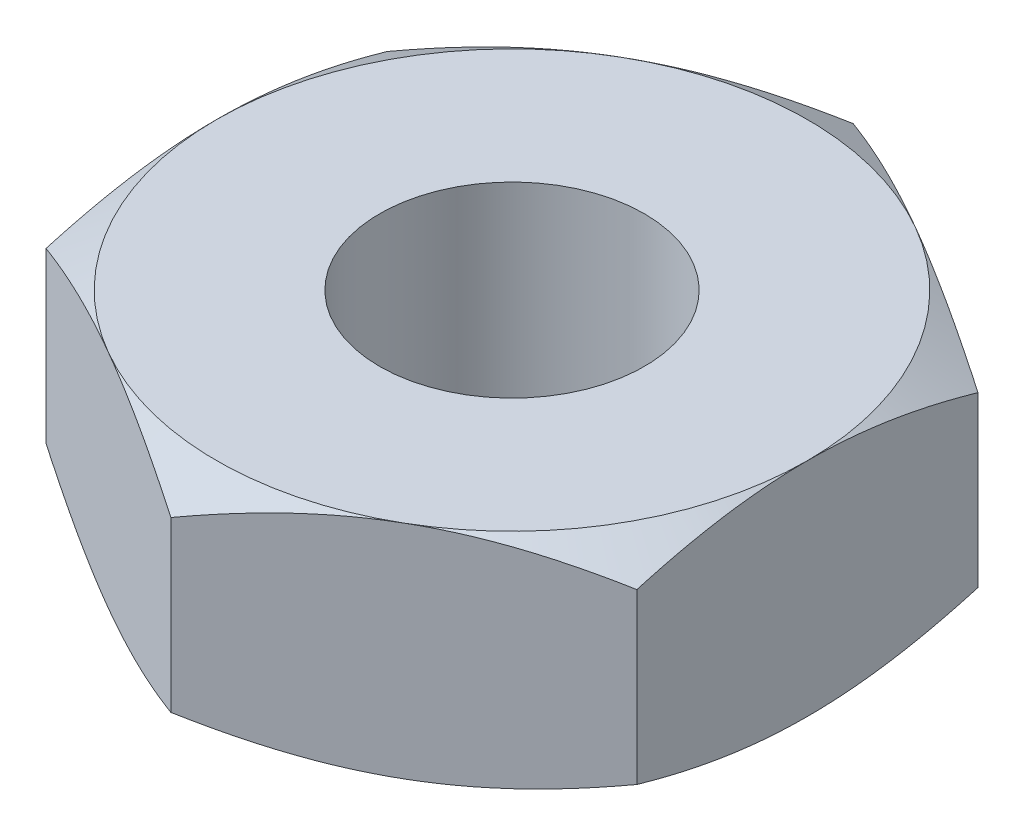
ISO-10303-21;
HEADER;
FILE_DESCRIPTION(('STEP AP214'),'2;1');
FILE_NAME('part.step','',(''),(''),'','','');
FILE_SCHEMA(('AUTOMOTIVE_DESIGN { 1 0 10303 214 1 1 1 1 }'));
ENDSEC;
DATA;
#1=APPLICATION_CONTEXT('core data for automotive mechanical design processes');
#2=APPLICATION_PROTOCOL_DEFINITION('international standard','automotive_design',2000,#1);
#3=PRODUCT_CONTEXT('',#1,'mechanical');
#4=PRODUCT('Part','Part','',(#3));
#5=PRODUCT_RELATED_PRODUCT_CATEGORY('part','',(#4));
#6=PRODUCT_DEFINITION_FORMATION('','',#4);
#7=PRODUCT_DEFINITION_CONTEXT('part definition',#1,'design');
#8=PRODUCT_DEFINITION('design','',#6,#7);
#9=PRODUCT_DEFINITION_SHAPE('','',#8);
#10=(LENGTH_UNIT() NAMED_UNIT(*) SI_UNIT(.MILLI.,.METRE.));
#11=(NAMED_UNIT(*) PLANE_ANGLE_UNIT() SI_UNIT($,.RADIAN.));
#12=(NAMED_UNIT(*) SI_UNIT($,.STERADIAN.) SOLID_ANGLE_UNIT());
#13=UNCERTAINTY_MEASURE_WITH_UNIT(LENGTH_MEASURE(1.E-05),#10,'distance_accuracy_value','');
#14=(GEOMETRIC_REPRESENTATION_CONTEXT(3) GLOBAL_UNCERTAINTY_ASSIGNED_CONTEXT((#13)) GLOBAL_UNIT_ASSIGNED_CONTEXT((#10,
#11,#12)) REPRESENTATION_CONTEXT('',''));
#15=CARTESIAN_POINT('',(0.,0.,0.));
#16=DIRECTION('',(0.,0.,1.));
#17=DIRECTION('',(1.,0.,0.));
#18=AXIS2_PLACEMENT_3D('',#15,#16,#17);
#19=CARTESIAN_POINT('',(-3.175,1.190625,-1.83308710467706));
#20=DIRECTION('',(0.,1.,0.));
#21=DIRECTION('',(0.,0.,1.));
#22=AXIS2_PLACEMENT_3D('',#19,#20,#21);
#23=PLANE('',#22);
#24=CARTESIAN_POINT('',(0.,1.190625,0.));
#25=DIRECTION('',(0.,1.,0.));
#26=DIRECTION('',(0.,0.,1.));
#27=AXIS2_PLACEMENT_3D('',#24,#25,#26);
#28=CIRCLE('',#27,1.4224);
#29=CARTESIAN_POINT('',(0.,1.190625,-1.4224));
#30=VERTEX_POINT('',#29);
#31=EDGE_CURVE('E240',#30,#30,#28,.T.);
#32=ORIENTED_EDGE('',*,*,#31,.F.);
#33=EDGE_LOOP('',(#32));
#34=FACE_BOUND('',#33,.T.);
#35=CARTESIAN_POINT('',(0.,1.190625,0.));
#36=DIRECTION('',(0.,1.,0.));
#37=DIRECTION('',(0.,0.,1.));
#38=AXIS2_PLACEMENT_3D('',#35,#36,#37);
#39=CIRCLE('',#38,3.175);
#40=CARTESIAN_POINT('',(-1.5875,1.190625,2.74963065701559));
#41=VERTEX_POINT('',#40);
#42=CARTESIAN_POINT('',(1.5875,1.190625,2.74963065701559));
#43=VERTEX_POINT('',#42);
#44=EDGE_CURVE('E299',#41,#43,#39,.T.);
#45=ORIENTED_EDGE('',*,*,#44,.T.);
#46=CARTESIAN_POINT('',(3.175,1.190625,0.));
#47=VERTEX_POINT('',#46);
#48=EDGE_CURVE('E302',#43,#47,#39,.T.);
#49=ORIENTED_EDGE('',*,*,#48,.T.);
#50=CARTESIAN_POINT('',(1.5875,1.190625,-2.74963065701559));
#51=VERTEX_POINT('',#50);
#52=EDGE_CURVE('E309',#47,#51,#39,.T.);
#53=ORIENTED_EDGE('',*,*,#52,.T.);
#54=CARTESIAN_POINT('',(-1.5875,1.190625,-2.74963065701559));
#55=VERTEX_POINT('',#54);
#56=EDGE_CURVE('E313',#51,#55,#39,.T.);
#57=ORIENTED_EDGE('',*,*,#56,.T.);
#58=CARTESIAN_POINT('',(-3.175,1.190625,0.));
#59=VERTEX_POINT('',#58);
#60=EDGE_CURVE('E306',#55,#59,#39,.T.);
#61=ORIENTED_EDGE('',*,*,#60,.T.);
#62=EDGE_CURVE('E301',#59,#41,#39,.T.);
#63=ORIENTED_EDGE('',*,*,#62,.T.);
#64=EDGE_LOOP('',(#45,#49,#53,#57,#61,#63));
#65=FACE_BOUND('',#64,.T.);
#66=ADVANCED_FACE('F36',(#34,#65),#23,.T.);
#67=CARTESIAN_POINT('',(0.,1.190625,-3.66617420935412));
#68=DIRECTION('',(0.5,0.,0.866025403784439));
#69=DIRECTION('',(0.866025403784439,0.,-0.5));
#70=AXIS2_PLACEMENT_3D('',#67,#68,#69);
#71=PLANE('',#70);
#72=DIRECTION('',(0.,-1.,0.));
#73=VECTOR('',#72,1.);
#74=CARTESIAN_POINT('',(0.,1.190625,-3.66617420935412));
#75=LINE('',#74,#73);
#76=CARTESIAN_POINT('',(0.,0.907045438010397,-3.66617420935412));
#77=VERTEX_POINT('',#76);
#78=CARTESIAN_POINT('',(0.,-0.907045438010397,-3.66617420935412));
#79=VERTEX_POINT('',#78);
#80=EDGE_CURVE('E237',#77,#79,#75,.T.);
#81=ORIENTED_EDGE('',*,*,#80,.T.);
#82=CARTESIAN_POINT('',(0.000199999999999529,-0.906978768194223,-3.66628967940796));
#83=CARTESIAN_POINT('',(-0.139325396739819,-0.953505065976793,-3.58573465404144));
#84=CARTESIAN_POINT('',(-0.280055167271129,-0.995819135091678,-3.50448428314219));
#85=CARTESIAN_POINT('',(-0.563951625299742,-1.06967899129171,-3.34057658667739));
#86=CARTESIAN_POINT('',(-0.707123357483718,-1.10119864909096,-3.25791634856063));
#87=CARTESIAN_POINT('',(-0.991692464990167,-1.15026389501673,-3.09362029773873));
#88=CARTESIAN_POINT('',(-1.1330460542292,-1.16813603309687,-3.01200976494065));
#89=CARTESIAN_POINT('',(-1.41641839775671,-1.1894721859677,-2.84840466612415));
#90=CARTESIAN_POINT('',(-1.55843612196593,-1.1929538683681,-2.76641069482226));
#91=CARTESIAN_POINT('',(-1.82380736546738,-1.18571329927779,-2.61319853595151));
#92=CARTESIAN_POINT('',(-1.94720059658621,-1.17676885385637,-2.54195742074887));
#93=CARTESIAN_POINT('',(-2.19318314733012,-1.14841942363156,-2.39993932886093));
#94=CARTESIAN_POINT('',(-2.31577161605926,-1.12900475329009,-2.32916284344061));
#95=CARTESIAN_POINT('',(-2.5622613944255,-1.08046926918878,-2.18685190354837));
#96=CARTESIAN_POINT('',(-2.68613150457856,-1.0511427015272,-2.11533546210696));
#97=CARTESIAN_POINT('',(-2.93202416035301,-0.984582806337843,-1.97336927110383));
#98=CARTESIAN_POINT('',(-3.05404985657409,-0.947365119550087,-1.90291770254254));
#99=CARTESIAN_POINT('',(-3.1752,-0.906978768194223,-1.83297163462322));
#100=B_SPLINE_CURVE_WITH_KNOTS('',3,(#82,#83,#84,#85,#86,#87,#88,#89,#90,#91,#92,#93,#94,#95,
#96,#97,#98,#99),.UNSPECIFIED.,.F.,.F.,(4,2,2,2,2,2,2,2,4),(0.,0.503278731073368,
1.00776724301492,1.49976968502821,1.99116790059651,2.41904879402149,2.84732618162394,
3.28510386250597,3.72202181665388),.UNSPECIFIED.);
#101=CARTESIAN_POINT('',(-1.5875,-1.190625,-2.74963065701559));
#102=VERTEX_POINT('',#101);
#103=EDGE_CURVE('E59',#79,#102,#100,.T.);
#104=ORIENTED_EDGE('',*,*,#103,.T.);
#105=CARTESIAN_POINT('',(-3.175,-0.907045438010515,-1.83308710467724));
#106=VERTEX_POINT('',#105);
#107=EDGE_CURVE('E195',#102,#106,#100,.T.);
#108=ORIENTED_EDGE('',*,*,#107,.T.);
#109=DIRECTION('',(0.,-1.,0.));
#110=VECTOR('',#109,1.);
#111=CARTESIAN_POINT('',(-3.175,1.190625,-1.83308710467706));
#112=LINE('',#111,#110);
#113=CARTESIAN_POINT('',(-3.175,0.907045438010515,-1.83308710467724));
#114=VERTEX_POINT('',#113);
#115=EDGE_CURVE('E225',#114,#106,#112,.T.);
#116=ORIENTED_EDGE('',*,*,#115,.F.);
#117=CARTESIAN_POINT('',(0.000199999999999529,0.906978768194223,-3.66628967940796));
#118=CARTESIAN_POINT('',(-0.139325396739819,0.953505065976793,-3.58573465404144));
#119=CARTESIAN_POINT('',(-0.280055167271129,0.995819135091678,-3.50448428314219));
#120=CARTESIAN_POINT('',(-0.563951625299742,1.06967899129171,-3.34057658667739));
#121=CARTESIAN_POINT('',(-0.707123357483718,1.10119864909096,-3.25791634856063));
#122=CARTESIAN_POINT('',(-0.991692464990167,1.15026389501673,-3.09362029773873));
#123=CARTESIAN_POINT('',(-1.1330460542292,1.16813603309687,-3.01200976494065));
#124=CARTESIAN_POINT('',(-1.41641839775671,1.1894721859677,-2.84840466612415));
#125=CARTESIAN_POINT('',(-1.55843612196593,1.1929538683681,-2.76641069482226));
#126=CARTESIAN_POINT('',(-1.82380736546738,1.18571329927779,-2.61319853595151));
#127=CARTESIAN_POINT('',(-1.94720059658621,1.17676885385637,-2.54195742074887));
#128=CARTESIAN_POINT('',(-2.19318314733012,1.14841942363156,-2.39993932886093));
#129=CARTESIAN_POINT('',(-2.31577161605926,1.12900475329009,-2.32916284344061));
#130=CARTESIAN_POINT('',(-2.5622613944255,1.08046926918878,-2.18685190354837));
#131=CARTESIAN_POINT('',(-2.68613150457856,1.0511427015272,-2.11533546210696));
#132=CARTESIAN_POINT('',(-2.93202416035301,0.984582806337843,-1.97336927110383));
#133=CARTESIAN_POINT('',(-3.05404985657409,0.947365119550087,-1.90291770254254));
#134=CARTESIAN_POINT('',(-3.1752,0.906978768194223,-1.83297163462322));
#135=B_SPLINE_CURVE_WITH_KNOTS('',3,(#117,#118,#119,#120,#121,#122,#123,#124,#125,#126,#127,
#128,#129,#130,#131,#132,#133,#134),.UNSPECIFIED.,.F.,.F.,(4,2,2,2,2,2,2,2,4),(0.,
0.503278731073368,1.00776724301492,1.49976968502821,1.99116790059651,2.41904879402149,
2.84732618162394,3.28510386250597,3.72202181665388),.UNSPECIFIED.);
#136=EDGE_CURVE('E247',#55,#114,#135,.T.);
#137=ORIENTED_EDGE('',*,*,#136,.F.);
#138=EDGE_CURVE('E244',#77,#55,#135,.T.);
#139=ORIENTED_EDGE('',*,*,#138,.F.);
#140=EDGE_LOOP('',(#81,#104,#108,#116,#137,#139));
#141=FACE_BOUND('',#140,.T.);
#142=ADVANCED_FACE('F38',(#141),#71,.F.);
#143=CARTESIAN_POINT('',(-3.175,1.190625,-1.83308710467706));
#144=DIRECTION('',(1.,0.,0.));
#145=DIRECTION('',(0.,0.,-1.));
#146=AXIS2_PLACEMENT_3D('',#143,#144,#145);
#147=PLANE('',#146);
#148=ORIENTED_EDGE('',*,*,#115,.T.);
#149=CARTESIAN_POINT('',(-3.175,0.390294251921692,-4.9885562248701));
#150=CARTESIAN_POINT('',(-3.175,0.322489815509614,-4.84930985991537));
#151=CARTESIAN_POINT('',(-3.175,0.255317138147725,-4.70975067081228));
#152=CARTESIAN_POINT('',(-3.175,0.12258942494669,-4.42984049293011));
#153=CARTESIAN_POINT('',(-3.175,0.057034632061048,-4.28948938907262));
#154=CARTESIAN_POINT('',(-3.175,-0.0724191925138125,-4.00713685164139));
#155=CARTESIAN_POINT('',(-3.175,-0.136307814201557,-3.86513062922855));
#156=CARTESIAN_POINT('',(-3.175,-0.261554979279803,-3.58001091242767));
#157=CARTESIAN_POINT('',(-3.175,-0.322913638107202,-3.43689746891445));
#158=CARTESIAN_POINT('',(-3.175,-0.444440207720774,-3.14451125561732));
#159=CARTESIAN_POINT('',(-3.175,-0.504499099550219,-2.99519293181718));
#160=CARTESIAN_POINT('',(-3.175,-0.620225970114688,-2.69483347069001));
#161=CARTESIAN_POINT('',(-3.175,-0.675893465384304,-2.54379214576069));
#162=CARTESIAN_POINT('',(-3.175,-0.781423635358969,-2.24000862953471));
#163=CARTESIAN_POINT('',(-3.175,-0.831297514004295,-2.08727036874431));
#164=CARTESIAN_POINT('',(-3.175,-0.923683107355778,-1.77960380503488));
#165=CARTESIAN_POINT('',(-3.175,-0.966197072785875,-1.62467618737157));
#166=CARTESIAN_POINT('',(-3.175,-1.04164079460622,-1.31339705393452));
#167=CARTESIAN_POINT('',(-3.175,-1.07462373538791,-1.15705866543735));
#168=CARTESIAN_POINT('',(-3.175,-1.12918141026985,-0.842371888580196));
#169=CARTESIAN_POINT('',(-3.175,-1.15075736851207,-0.684023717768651));
#170=CARTESIAN_POINT('',(-3.175,-1.18050055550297,-0.368202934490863));
#171=CARTESIAN_POINT('',(-3.175,-1.18884523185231,-0.210747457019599));
#172=CARTESIAN_POINT('',(-3.175,-1.1918898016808,0.104311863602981));
#173=CARTESIAN_POINT('',(-3.175,-1.18658947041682,0.261915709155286));
#174=CARTESIAN_POINT('',(-3.175,-1.16653654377,0.527563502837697));
#175=CARTESIAN_POINT('',(-3.175,-1.15520814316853,0.635883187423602));
#176=CARTESIAN_POINT('',(-3.175,-1.12677659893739,0.851767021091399));
#177=CARTESIAN_POINT('',(-3.175,-1.10967272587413,0.959331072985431));
#178=CARTESIAN_POINT('',(-3.175,-1.05059305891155,1.28072262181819));
#179=CARTESIAN_POINT('',(-3.175,-1.00085846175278,1.49314180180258));
#180=CARTESIAN_POINT('',(-3.175,-0.914125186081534,1.81092381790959));
#181=CARTESIAN_POINT('',(-3.175,-0.882764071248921,1.91791944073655));
#182=CARTESIAN_POINT('',(-3.175,-0.816663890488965,2.13087224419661));
#183=CARTESIAN_POINT('',(-3.175,-0.781924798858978,2.2368294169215));
#184=CARTESIAN_POINT('',(-3.175,-0.709636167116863,2.44773776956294));
#185=CARTESIAN_POINT('',(-3.175,-0.672087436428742,2.55268922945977));
#186=CARTESIAN_POINT('',(-3.175,-0.594633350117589,2.76171343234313));
#187=CARTESIAN_POINT('',(-3.175,-0.554728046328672,2.86578619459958));
#188=CARTESIAN_POINT('',(-3.175,-0.445219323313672,3.14347672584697));
#189=CARTESIAN_POINT('',(-3.175,-0.37382985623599,3.31638946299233));
#190=CARTESIAN_POINT('',(-3.175,-0.226917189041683,3.6604562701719));
#191=CARTESIAN_POINT('',(-3.175,-0.151393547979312,3.83161015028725));
#192=CARTESIAN_POINT('',(-3.175,0.00281456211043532,4.17255282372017));
#193=CARTESIAN_POINT('',(-3.175,0.0815000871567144,4.34234113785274));
#194=CARTESIAN_POINT('',(-3.175,0.241296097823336,4.68077493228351));
#195=CARTESIAN_POINT('',(-3.175,0.32240665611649,4.84942037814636));
#196=CARTESIAN_POINT('',(-3.175,0.568804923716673,5.35449457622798));
#197=CARTESIAN_POINT('',(-3.175,0.736920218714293,5.68954214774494));
#198=CARTESIAN_POINT('',(-3.175,1.0778933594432,6.35711088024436));
#199=CARTESIAN_POINT('',(-3.175,1.25075023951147,6.68963253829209));
#200=CARTESIAN_POINT('',(-3.175,1.58151406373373,7.31837652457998));
#201=CARTESIAN_POINT('',(-3.175,1.73910012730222,7.61476795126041));
#202=CARTESIAN_POINT('',(-3.175,2.05618136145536,8.20654888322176));
#203=CARTESIAN_POINT('',(-3.175,2.21567664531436,8.50193832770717));
#204=CARTESIAN_POINT('',(-3.175,2.53555835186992,9.09097563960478));
#205=CARTESIAN_POINT('',(-3.175,2.6959401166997,9.38462603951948));
#206=CARTESIAN_POINT('',(-3.175,3.01779202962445,9.97130061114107));
#207=CARTESIAN_POINT('',(-3.175,3.1792620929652,10.2643248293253));
#208=CARTESIAN_POINT('',(-3.175,3.34112844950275,10.5571284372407));
#209=B_SPLINE_CURVE_WITH_KNOTS('',3,(#149,#150,#151,#152,#153,#154,#155,#156,#157,#158,#159,
#160,#161,#162,#163,#164,#165,#166,#167,#168,#169,#170,#171,#172,#173,#174,#175,#176,#177,#178,
#179,#180,#181,#182,#183,#184,#185,#186,#187,#188,#189,#190,#191,#192,#193,#194,#195,#196,#197,
#198,#199,#200,#201,#202,#203,#204,#205,#206,#207,#208),.UNSPECIFIED.,.F.,.F.,(4,2,2,2,2,2,2,2,
2,2,2,2,2,2,2,2,2,2,2,2,2,2,2,2,2,2,2,2,2,4),(0.,0.464637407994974,0.929344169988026,
1.39647286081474,1.86358021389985,2.34635936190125,2.82919158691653,3.31107397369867,
3.79280873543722,4.27180101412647,4.75074187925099,5.22320352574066,5.6956729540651,
6.0222471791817,6.34886266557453,7.00241647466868,7.33687734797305,7.67134076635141,
8.00570819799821,8.34006827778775,8.90119903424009,9.46238975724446,10.0237694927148,
10.5851660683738,11.7096730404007,12.8339526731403,13.8409839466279,14.8480752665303,
15.8518534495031,16.8555543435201),.UNSPECIFIED.);
#210=CARTESIAN_POINT('',(-3.175,-1.190625,0.));
#211=VERTEX_POINT('',#210);
#212=EDGE_CURVE('E280',#106,#211,#209,.T.);
#213=ORIENTED_EDGE('',*,*,#212,.T.);
#214=CARTESIAN_POINT('',(-3.175,-0.907045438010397,1.83308710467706));
#215=VERTEX_POINT('',#214);
#216=EDGE_CURVE('E274',#211,#215,#209,.T.);
#217=ORIENTED_EDGE('',*,*,#216,.T.);
#218=DIRECTION('',(0.,-1.,0.));
#219=VECTOR('',#218,1.);
#220=CARTESIAN_POINT('',(-3.175,1.190625,1.83308710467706));
#221=LINE('',#220,#219);
#222=CARTESIAN_POINT('',(-3.175,0.907045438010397,1.83308710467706));
#223=VERTEX_POINT('',#222);
#224=EDGE_CURVE('E228',#223,#215,#221,.T.);
#225=ORIENTED_EDGE('',*,*,#224,.F.);
#226=CARTESIAN_POINT('',(-3.175,-0.390294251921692,-4.9885562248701));
#227=CARTESIAN_POINT('',(-3.175,-0.322489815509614,-4.84930985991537));
#228=CARTESIAN_POINT('',(-3.175,-0.255317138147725,-4.70975067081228));
#229=CARTESIAN_POINT('',(-3.175,-0.12258942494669,-4.42984049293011));
#230=CARTESIAN_POINT('',(-3.175,-0.057034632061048,-4.28948938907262));
#231=CARTESIAN_POINT('',(-3.175,0.0724191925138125,-4.00713685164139));
#232=CARTESIAN_POINT('',(-3.175,0.136307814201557,-3.86513062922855));
#233=CARTESIAN_POINT('',(-3.175,0.261554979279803,-3.58001091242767));
#234=CARTESIAN_POINT('',(-3.175,0.322913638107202,-3.43689746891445));
#235=CARTESIAN_POINT('',(-3.175,0.444440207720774,-3.14451125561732));
#236=CARTESIAN_POINT('',(-3.175,0.504499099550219,-2.99519293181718));
#237=CARTESIAN_POINT('',(-3.175,0.620225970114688,-2.69483347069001));
#238=CARTESIAN_POINT('',(-3.175,0.675893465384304,-2.54379214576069));
#239=CARTESIAN_POINT('',(-3.175,0.781423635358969,-2.24000862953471));
#240=CARTESIAN_POINT('',(-3.175,0.831297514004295,-2.08727036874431));
#241=CARTESIAN_POINT('',(-3.175,0.923683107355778,-1.77960380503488));
#242=CARTESIAN_POINT('',(-3.175,0.966197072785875,-1.62467618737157));
#243=CARTESIAN_POINT('',(-3.175,1.04164079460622,-1.31339705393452));
#244=CARTESIAN_POINT('',(-3.175,1.07462373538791,-1.15705866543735));
#245=CARTESIAN_POINT('',(-3.175,1.12918141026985,-0.842371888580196));
#246=CARTESIAN_POINT('',(-3.175,1.15075736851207,-0.684023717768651));
#247=CARTESIAN_POINT('',(-3.175,1.18050055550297,-0.368202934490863));
#248=CARTESIAN_POINT('',(-3.175,1.18884523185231,-0.210747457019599));
#249=CARTESIAN_POINT('',(-3.175,1.1918898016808,0.104311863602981));
#250=CARTESIAN_POINT('',(-3.175,1.18658947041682,0.261915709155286));
#251=CARTESIAN_POINT('',(-3.175,1.16653654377,0.527563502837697));
#252=CARTESIAN_POINT('',(-3.175,1.15520814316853,0.635883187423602));
#253=CARTESIAN_POINT('',(-3.175,1.12677659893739,0.851767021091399));
#254=CARTESIAN_POINT('',(-3.175,1.10967272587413,0.959331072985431));
#255=CARTESIAN_POINT('',(-3.175,1.05059305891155,1.28072262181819));
#256=CARTESIAN_POINT('',(-3.175,1.00085846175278,1.49314180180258));
#257=CARTESIAN_POINT('',(-3.175,0.914125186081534,1.81092381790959));
#258=CARTESIAN_POINT('',(-3.175,0.882764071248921,1.91791944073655));
#259=CARTESIAN_POINT('',(-3.175,0.816663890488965,2.13087224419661));
#260=CARTESIAN_POINT('',(-3.175,0.781924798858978,2.2368294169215));
#261=CARTESIAN_POINT('',(-3.175,0.709636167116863,2.44773776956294));
#262=CARTESIAN_POINT('',(-3.175,0.672087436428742,2.55268922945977));
#263=CARTESIAN_POINT('',(-3.175,0.594633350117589,2.76171343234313));
#264=CARTESIAN_POINT('',(-3.175,0.554728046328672,2.86578619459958));
#265=CARTESIAN_POINT('',(-3.175,0.445219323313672,3.14347672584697));
#266=CARTESIAN_POINT('',(-3.175,0.37382985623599,3.31638946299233));
#267=CARTESIAN_POINT('',(-3.175,0.226917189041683,3.6604562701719));
#268=CARTESIAN_POINT('',(-3.175,0.151393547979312,3.83161015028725));
#269=CARTESIAN_POINT('',(-3.175,-0.00281456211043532,4.17255282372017));
#270=CARTESIAN_POINT('',(-3.175,-0.0815000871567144,4.34234113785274));
#271=CARTESIAN_POINT('',(-3.175,-0.241296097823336,4.68077493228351));
#272=CARTESIAN_POINT('',(-3.175,-0.32240665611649,4.84942037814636));
#273=CARTESIAN_POINT('',(-3.175,-0.568804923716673,5.35449457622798));
#274=CARTESIAN_POINT('',(-3.175,-0.736920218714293,5.68954214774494));
#275=CARTESIAN_POINT('',(-3.175,-1.0778933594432,6.35711088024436));
#276=CARTESIAN_POINT('',(-3.175,-1.25075023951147,6.68963253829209));
#277=CARTESIAN_POINT('',(-3.175,-1.58151406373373,7.31837652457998));
#278=CARTESIAN_POINT('',(-3.175,-1.73910012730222,7.61476795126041));
#279=CARTESIAN_POINT('',(-3.175,-2.05618136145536,8.20654888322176));
#280=CARTESIAN_POINT('',(-3.175,-2.21567664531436,8.50193832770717));
#281=CARTESIAN_POINT('',(-3.175,-2.53555835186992,9.09097563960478));
#282=CARTESIAN_POINT('',(-3.175,-2.6959401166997,9.38462603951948));
#283=CARTESIAN_POINT('',(-3.175,-3.01779202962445,9.97130061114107));
#284=CARTESIAN_POINT('',(-3.175,-3.1792620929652,10.2643248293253));
#285=CARTESIAN_POINT('',(-3.175,-3.34112844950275,10.5571284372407));
#286=B_SPLINE_CURVE_WITH_KNOTS('',3,(#226,#227,#228,#229,#230,#231,#232,#233,#234,#235,#236,
#237,#238,#239,#240,#241,#242,#243,#244,#245,#246,#247,#248,#249,#250,#251,#252,#253,#254,#255,
#256,#257,#258,#259,#260,#261,#262,#263,#264,#265,#266,#267,#268,#269,#270,#271,#272,#273,#274,
#275,#276,#277,#278,#279,#280,#281,#282,#283,#284,#285),.UNSPECIFIED.,.F.,.F.,(4,2,2,2,2,2,2,2,
2,2,2,2,2,2,2,2,2,2,2,2,2,2,2,2,2,2,2,2,2,4),(0.,0.464637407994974,0.929344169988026,
1.39647286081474,1.86358021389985,2.34635936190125,2.82919158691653,3.31107397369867,
3.79280873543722,4.27180101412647,4.75074187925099,5.22320352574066,5.6956729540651,
6.0222471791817,6.34886266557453,7.00241647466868,7.33687734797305,7.67134076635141,
8.00570819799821,8.34006827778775,8.90119903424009,9.46238975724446,10.0237694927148,
10.5851660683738,11.7096730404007,12.8339526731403,13.8409839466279,14.8480752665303,
15.8518534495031,16.8555543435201),.UNSPECIFIED.);
#287=EDGE_CURVE('E254',#59,#223,#286,.T.);
#288=ORIENTED_EDGE('',*,*,#287,.F.);
#289=EDGE_CURVE('E253',#114,#59,#286,.T.);
#290=ORIENTED_EDGE('',*,*,#289,.F.);
#291=EDGE_LOOP('',(#148,#213,#217,#225,#288,#290));
#292=FACE_BOUND('',#291,.T.);
#293=ADVANCED_FACE('F267',(#292),#147,.F.);
#294=CARTESIAN_POINT('',(-3.175,1.190625,1.83308710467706));
#295=DIRECTION('',(0.5,0.,-0.866025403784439));
#296=DIRECTION('',(-0.866025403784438,0.,-0.5));
#297=AXIS2_PLACEMENT_3D('',#294,#295,#296);
#298=PLANE('',#297);
#299=ORIENTED_EDGE('',*,*,#224,.T.);
#300=CARTESIAN_POINT('',(-3.1752,-0.906978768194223,1.83297163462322));
#301=CARTESIAN_POINT('',(-3.03567460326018,-0.953505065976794,1.91352665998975));
#302=CARTESIAN_POINT('',(-2.89494483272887,-0.995819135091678,1.99477703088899));
#303=CARTESIAN_POINT('',(-2.61104837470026,-1.06967899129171,2.15868472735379));
#304=CARTESIAN_POINT('',(-2.46787664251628,-1.10119864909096,2.24134496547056));
#305=CARTESIAN_POINT('',(-2.18330753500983,-1.15026389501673,2.40564101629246));
#306=CARTESIAN_POINT('',(-2.0419539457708,-1.16813603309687,2.48725154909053));
#307=CARTESIAN_POINT('',(-1.75858160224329,-1.1894721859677,2.65085664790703));
#308=CARTESIAN_POINT('',(-1.61656387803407,-1.1929538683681,2.73285061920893));
#309=CARTESIAN_POINT('',(-1.35119263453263,-1.18571329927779,2.88606277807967));
#310=CARTESIAN_POINT('',(-1.22779940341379,-1.17676885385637,2.95730389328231));
#311=CARTESIAN_POINT('',(-0.981816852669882,-1.14841942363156,3.09932198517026));
#312=CARTESIAN_POINT('',(-0.859228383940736,-1.12900475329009,3.17009847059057));
#313=CARTESIAN_POINT('',(-0.612738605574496,-1.08046926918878,3.31240941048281));
#314=CARTESIAN_POINT('',(-0.488868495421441,-1.0511427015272,3.38392585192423));
#315=CARTESIAN_POINT('',(-0.242975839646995,-0.984582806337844,3.52589204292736));
#316=CARTESIAN_POINT('',(-0.120950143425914,-0.947365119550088,3.59634361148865));
#317=CARTESIAN_POINT('',(0.000199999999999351,-0.906978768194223,3.66628967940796));
#318=B_SPLINE_CURVE_WITH_KNOTS('',3,(#300,#301,#302,#303,#304,#305,#306,#307,#308,#309,#310,
#311,#312,#313,#314,#315,#316,#317),.UNSPECIFIED.,.F.,.F.,(4,2,2,2,2,2,2,2,4),(0.,
0.503278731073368,1.00776724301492,1.49976968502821,1.99116790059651,2.41904879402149,
2.84732618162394,3.28510386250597,3.72202181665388),.UNSPECIFIED.);
#319=CARTESIAN_POINT('',(-1.5875,-1.190625,2.74963065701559));
#320=VERTEX_POINT('',#319);
#321=EDGE_CURVE('E160',#215,#320,#318,.T.);
#322=ORIENTED_EDGE('',*,*,#321,.T.);
#323=CARTESIAN_POINT('',(0.,-0.907045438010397,3.66617420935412));
#324=VERTEX_POINT('',#323);
#325=EDGE_CURVE('E144',#320,#324,#318,.T.);
#326=ORIENTED_EDGE('',*,*,#325,.T.);
#327=DIRECTION('',(0.,-1.,0.));
#328=VECTOR('',#327,1.);
#329=CARTESIAN_POINT('',(0.,1.190625,3.66617420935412));
#330=LINE('',#329,#328);
#331=CARTESIAN_POINT('',(0.,0.907045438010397,3.66617420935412));
#332=VERTEX_POINT('',#331);
#333=EDGE_CURVE('E159',#332,#324,#330,.T.);
#334=ORIENTED_EDGE('',*,*,#333,.F.);
#335=CARTESIAN_POINT('',(-3.1752,0.906978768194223,1.83297163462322));
#336=CARTESIAN_POINT('',(-3.03567460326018,0.953505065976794,1.91352665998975));
#337=CARTESIAN_POINT('',(-2.89494483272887,0.995819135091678,1.99477703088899));
#338=CARTESIAN_POINT('',(-2.61104837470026,1.06967899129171,2.15868472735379));
#339=CARTESIAN_POINT('',(-2.46787664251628,1.10119864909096,2.24134496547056));
#340=CARTESIAN_POINT('',(-2.18330753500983,1.15026389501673,2.40564101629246));
#341=CARTESIAN_POINT('',(-2.0419539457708,1.16813603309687,2.48725154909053));
#342=CARTESIAN_POINT('',(-1.75858160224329,1.1894721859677,2.65085664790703));
#343=CARTESIAN_POINT('',(-1.61656387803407,1.1929538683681,2.73285061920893));
#344=CARTESIAN_POINT('',(-1.35119263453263,1.18571329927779,2.88606277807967));
#345=CARTESIAN_POINT('',(-1.22779940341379,1.17676885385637,2.95730389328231));
#346=CARTESIAN_POINT('',(-0.981816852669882,1.14841942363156,3.09932198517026));
#347=CARTESIAN_POINT('',(-0.859228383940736,1.12900475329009,3.17009847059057));
#348=CARTESIAN_POINT('',(-0.612738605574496,1.08046926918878,3.31240941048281));
#349=CARTESIAN_POINT('',(-0.488868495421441,1.0511427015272,3.38392585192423));
#350=CARTESIAN_POINT('',(-0.242975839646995,0.984582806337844,3.52589204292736));
#351=CARTESIAN_POINT('',(-0.120950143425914,0.947365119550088,3.59634361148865));
#352=CARTESIAN_POINT('',(0.000199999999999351,0.906978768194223,3.66628967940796));
#353=B_SPLINE_CURVE_WITH_KNOTS('',3,(#335,#336,#337,#338,#339,#340,#341,#342,#343,#344,#345,
#346,#347,#348,#349,#350,#351,#352),.UNSPECIFIED.,.F.,.F.,(4,2,2,2,2,2,2,2,4),(0.,
0.503278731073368,1.00776724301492,1.49976968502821,1.99116790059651,2.41904879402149,
2.84732618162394,3.28510386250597,3.72202181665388),.UNSPECIFIED.);
#354=EDGE_CURVE('E261',#41,#332,#353,.T.);
#355=ORIENTED_EDGE('',*,*,#354,.F.);
#356=EDGE_CURVE('E260',#223,#41,#353,.T.);
#357=ORIENTED_EDGE('',*,*,#356,.F.);
#358=EDGE_LOOP('',(#299,#322,#326,#334,#355,#357));
#359=FACE_BOUND('',#358,.T.);
#360=ADVANCED_FACE('F270',(#359),#298,.F.);
#361=CARTESIAN_POINT('',(0.,1.190625,3.66617420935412));
#362=DIRECTION('',(-0.5,0.,-0.866025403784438));
#363=DIRECTION('',(-0.866025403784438,0.,0.5));
#364=AXIS2_PLACEMENT_3D('',#361,#362,#363);
#365=PLANE('',#364);
#366=ORIENTED_EDGE('',*,*,#333,.T.);
#367=CARTESIAN_POINT('',(-0.000200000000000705,-0.906978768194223,3.66628967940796));
#368=CARTESIAN_POINT('',(0.139325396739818,-0.953505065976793,3.58573465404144));
#369=CARTESIAN_POINT('',(0.280055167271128,-0.995819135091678,3.50448428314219));
#370=CARTESIAN_POINT('',(0.563951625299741,-1.06967899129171,3.34057658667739));
#371=CARTESIAN_POINT('',(0.707123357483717,-1.10119864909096,3.25791634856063));
#372=CARTESIAN_POINT('',(0.991692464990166,-1.15026389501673,3.09362029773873));
#373=CARTESIAN_POINT('',(1.1330460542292,-1.16813603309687,3.01200976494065));
#374=CARTESIAN_POINT('',(1.41641839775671,-1.1894721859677,2.84840466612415));
#375=CARTESIAN_POINT('',(1.55843612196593,-1.1929538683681,2.76641069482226));
#376=CARTESIAN_POINT('',(1.82380736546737,-1.18571329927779,2.61319853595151));
#377=CARTESIAN_POINT('',(1.94720059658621,-1.17676885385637,2.54195742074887));
#378=CARTESIAN_POINT('',(2.19318314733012,-1.14841942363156,2.39993932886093));
#379=CARTESIAN_POINT('',(2.31577161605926,-1.1290047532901,2.32916284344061));
#380=CARTESIAN_POINT('',(2.5622613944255,-1.08046926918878,2.18685190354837));
#381=CARTESIAN_POINT('',(2.68613150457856,-1.0511427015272,2.11533546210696));
#382=CARTESIAN_POINT('',(2.93202416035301,-0.984582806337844,1.97336927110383));
#383=CARTESIAN_POINT('',(3.05404985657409,-0.947365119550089,1.90291770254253));
#384=CARTESIAN_POINT('',(3.1752,-0.906978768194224,1.83297163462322));
#385=B_SPLINE_CURVE_WITH_KNOTS('',3,(#367,#368,#369,#370,#371,#372,#373,#374,#375,#376,#377,
#378,#379,#380,#381,#382,#383,#384),.UNSPECIFIED.,.F.,.F.,(4,2,2,2,2,2,2,2,4),(0.,
0.503278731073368,1.00776724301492,1.49976968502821,1.99116790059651,2.41904879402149,
2.84732618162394,3.28510386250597,3.72202181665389),.UNSPECIFIED.);
#386=CARTESIAN_POINT('',(1.5875,-1.190625,2.74963065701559));
#387=VERTEX_POINT('',#386);
#388=EDGE_CURVE('E138',#324,#387,#385,.T.);
#389=ORIENTED_EDGE('',*,*,#388,.T.);
#390=CARTESIAN_POINT('',(3.175,-0.907045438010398,1.83308710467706));
#391=VERTEX_POINT('',#390);
#392=EDGE_CURVE('E126',#387,#391,#385,.T.);
#393=ORIENTED_EDGE('',*,*,#392,.T.);
#394=DIRECTION('',(0.,-1.,0.));
#395=VECTOR('',#394,1.);
#396=CARTESIAN_POINT('',(3.175,1.190625,1.83308710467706));
#397=LINE('',#396,#395);
#398=CARTESIAN_POINT('',(3.175,0.907045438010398,1.83308710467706));
#399=VERTEX_POINT('',#398);
#400=EDGE_CURVE('E232',#399,#391,#397,.T.);
#401=ORIENTED_EDGE('',*,*,#400,.F.);
#402=CARTESIAN_POINT('',(-0.000200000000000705,0.906978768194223,3.66628967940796));
#403=CARTESIAN_POINT('',(0.139325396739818,0.953505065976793,3.58573465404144));
#404=CARTESIAN_POINT('',(0.280055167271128,0.995819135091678,3.50448428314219));
#405=CARTESIAN_POINT('',(0.563951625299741,1.06967899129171,3.34057658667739));
#406=CARTESIAN_POINT('',(0.707123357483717,1.10119864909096,3.25791634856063));
#407=CARTESIAN_POINT('',(0.991692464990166,1.15026389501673,3.09362029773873));
#408=CARTESIAN_POINT('',(1.1330460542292,1.16813603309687,3.01200976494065));
#409=CARTESIAN_POINT('',(1.41641839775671,1.1894721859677,2.84840466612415));
#410=CARTESIAN_POINT('',(1.55843612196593,1.1929538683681,2.76641069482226));
#411=CARTESIAN_POINT('',(1.82380736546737,1.18571329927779,2.61319853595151));
#412=CARTESIAN_POINT('',(1.94720059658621,1.17676885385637,2.54195742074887));
#413=CARTESIAN_POINT('',(2.19318314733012,1.14841942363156,2.39993932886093));
#414=CARTESIAN_POINT('',(2.31577161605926,1.1290047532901,2.32916284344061));
#415=CARTESIAN_POINT('',(2.5622613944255,1.08046926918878,2.18685190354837));
#416=CARTESIAN_POINT('',(2.68613150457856,1.0511427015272,2.11533546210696));
#417=CARTESIAN_POINT('',(2.93202416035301,0.984582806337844,1.97336927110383));
#418=CARTESIAN_POINT('',(3.05404985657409,0.947365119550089,1.90291770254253));
#419=CARTESIAN_POINT('',(3.1752,0.906978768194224,1.83297163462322));
#420=B_SPLINE_CURVE_WITH_KNOTS('',3,(#402,#403,#404,#405,#406,#407,#408,#409,#410,#411,#412,
#413,#414,#415,#416,#417,#418,#419),.UNSPECIFIED.,.F.,.F.,(4,2,2,2,2,2,2,2,4),(0.,
0.503278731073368,1.00776724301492,1.49976968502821,1.99116790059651,2.41904879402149,
2.84732618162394,3.28510386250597,3.72202181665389),.UNSPECIFIED.);
#421=EDGE_CURVE('E331',#43,#399,#420,.T.);
#422=ORIENTED_EDGE('',*,*,#421,.F.);
#423=EDGE_CURVE('E333',#332,#43,#420,.T.);
#424=ORIENTED_EDGE('',*,*,#423,.F.);
#425=EDGE_LOOP('',(#366,#389,#393,#401,#422,#424));
#426=FACE_BOUND('',#425,.T.);
#427=ADVANCED_FACE('F156',(#426),#365,.F.);
#428=CARTESIAN_POINT('',(3.175,1.190625,1.83308710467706));
#429=DIRECTION('',(-1.,0.,0.));
#430=DIRECTION('',(0.,0.,1.));
#431=AXIS2_PLACEMENT_3D('',#428,#429,#430);
#432=PLANE('',#431);
#433=ORIENTED_EDGE('',*,*,#400,.T.);
#434=CARTESIAN_POINT('',(3.175,0.390294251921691,-4.9885562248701));
#435=CARTESIAN_POINT('',(3.175,0.322489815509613,-4.84930985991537));
#436=CARTESIAN_POINT('',(3.175,0.255317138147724,-4.70975067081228));
#437=CARTESIAN_POINT('',(3.175,0.122589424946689,-4.42984049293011));
#438=CARTESIAN_POINT('',(3.175,0.0570346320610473,-4.28948938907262));
#439=CARTESIAN_POINT('',(3.175,-0.0724191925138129,-4.00713685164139));
#440=CARTESIAN_POINT('',(3.175,-0.136307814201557,-3.86513062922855));
#441=CARTESIAN_POINT('',(3.175,-0.261554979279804,-3.58001091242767));
#442=CARTESIAN_POINT('',(3.175,-0.322913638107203,-3.43689746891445));
#443=CARTESIAN_POINT('',(3.175,-0.444440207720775,-3.14451125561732));
#444=CARTESIAN_POINT('',(3.175,-0.50449909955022,-2.99519293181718));
#445=CARTESIAN_POINT('',(3.175,-0.620225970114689,-2.69483347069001));
#446=CARTESIAN_POINT('',(3.175,-0.675893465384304,-2.54379214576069));
#447=CARTESIAN_POINT('',(3.175,-0.78142363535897,-2.24000862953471));
#448=CARTESIAN_POINT('',(3.175,-0.831297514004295,-2.08727036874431));
#449=CARTESIAN_POINT('',(3.175,-0.923683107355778,-1.77960380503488));
#450=CARTESIAN_POINT('',(3.175,-0.966197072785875,-1.62467618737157));
#451=CARTESIAN_POINT('',(3.175,-1.04164079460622,-1.31339705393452));
#452=CARTESIAN_POINT('',(3.175,-1.07462373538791,-1.15705866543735));
#453=CARTESIAN_POINT('',(3.175,-1.12918141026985,-0.842371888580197));
#454=CARTESIAN_POINT('',(3.175,-1.15075736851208,-0.684023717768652));
#455=CARTESIAN_POINT('',(3.175,-1.18050055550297,-0.368202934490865));
#456=CARTESIAN_POINT('',(3.175,-1.18884523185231,-0.210747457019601));
#457=CARTESIAN_POINT('',(3.175,-1.1918898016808,0.104311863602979));
#458=CARTESIAN_POINT('',(3.175,-1.18658947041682,0.261915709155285));
#459=CARTESIAN_POINT('',(3.175,-1.16653654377,0.527563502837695));
#460=CARTESIAN_POINT('',(3.175,-1.15520814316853,0.6358831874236));
#461=CARTESIAN_POINT('',(3.175,-1.12677659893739,0.851767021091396));
#462=CARTESIAN_POINT('',(3.175,-1.10967272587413,0.959331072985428));
#463=CARTESIAN_POINT('',(3.175,-1.05059305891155,1.28072262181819));
#464=CARTESIAN_POINT('',(3.175,-1.00085846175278,1.49314180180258));
#465=CARTESIAN_POINT('',(3.175,-0.914125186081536,1.81092381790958));
#466=CARTESIAN_POINT('',(3.175,-0.882764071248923,1.91791944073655));
#467=CARTESIAN_POINT('',(3.175,-0.816663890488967,2.1308722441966));
#468=CARTESIAN_POINT('',(3.175,-0.78192479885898,2.23682941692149));
#469=CARTESIAN_POINT('',(3.175,-0.709636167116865,2.44773776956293));
#470=CARTESIAN_POINT('',(3.175,-0.672087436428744,2.55268922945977));
#471=CARTESIAN_POINT('',(3.175,-0.594633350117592,2.76171343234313));
#472=CARTESIAN_POINT('',(3.175,-0.554728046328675,2.86578619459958));
#473=CARTESIAN_POINT('',(3.175,-0.445219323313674,3.14347672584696));
#474=CARTESIAN_POINT('',(3.175,-0.373829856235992,3.31638946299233));
#475=CARTESIAN_POINT('',(3.175,-0.226917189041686,3.66045627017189));
#476=CARTESIAN_POINT('',(3.175,-0.151393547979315,3.83161015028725));
#477=CARTESIAN_POINT('',(3.175,0.00281456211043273,4.17255282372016));
#478=CARTESIAN_POINT('',(3.175,0.0815000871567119,4.34234113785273));
#479=CARTESIAN_POINT('',(3.175,0.241296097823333,4.68077493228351));
#480=CARTESIAN_POINT('',(3.175,0.322406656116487,4.84942037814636));
#481=CARTESIAN_POINT('',(3.175,0.56880492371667,5.35449457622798));
#482=CARTESIAN_POINT('',(3.175,0.73692021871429,5.68954214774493));
#483=CARTESIAN_POINT('',(3.175,1.0778933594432,6.35711088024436));
#484=CARTESIAN_POINT('',(3.175,1.25075023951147,6.68963253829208));
#485=CARTESIAN_POINT('',(3.175,1.58151406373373,7.31837652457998));
#486=CARTESIAN_POINT('',(3.175,1.73910012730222,7.61476795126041));
#487=CARTESIAN_POINT('',(3.175,2.05618136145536,8.20654888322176));
#488=CARTESIAN_POINT('',(3.175,2.21567664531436,8.50193832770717));
#489=CARTESIAN_POINT('',(3.175,2.53555835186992,9.09097563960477));
#490=CARTESIAN_POINT('',(3.175,2.6959401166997,9.38462603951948));
#491=CARTESIAN_POINT('',(3.175,3.01779202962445,9.97130061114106));
#492=CARTESIAN_POINT('',(3.175,3.1792620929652,10.2643248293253));
#493=CARTESIAN_POINT('',(3.175,3.34112844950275,10.5571284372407));
#494=B_SPLINE_CURVE_WITH_KNOTS('',3,(#434,#435,#436,#437,#438,#439,#440,#441,#442,#443,#444,
#445,#446,#447,#448,#449,#450,#451,#452,#453,#454,#455,#456,#457,#458,#459,#460,#461,#462,#463,
#464,#465,#466,#467,#468,#469,#470,#471,#472,#473,#474,#475,#476,#477,#478,#479,#480,#481,#482,
#483,#484,#485,#486,#487,#488,#489,#490,#491,#492,#493),.UNSPECIFIED.,.F.,.F.,(4,2,2,2,2,2,2,2,
2,2,2,2,2,2,2,2,2,2,2,2,2,2,2,2,2,2,2,2,2,4),(0.,0.464637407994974,0.929344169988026,
1.39647286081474,1.86358021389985,2.34635936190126,2.82919158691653,3.31107397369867,
3.79280873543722,4.27180101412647,4.75074187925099,5.22320352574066,5.6956729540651,
6.02224717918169,6.34886266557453,7.00241647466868,7.33687734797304,7.6713407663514,
8.0057081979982,8.34006827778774,8.90119903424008,9.46238975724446,10.0237694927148,
10.5851660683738,11.7096730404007,12.8339526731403,13.8409839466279,14.8480752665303,
15.851853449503,16.8555543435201),.UNSPECIFIED.);
#495=CARTESIAN_POINT('',(3.175,-1.190625,0.));
#496=VERTEX_POINT('',#495);
#497=EDGE_CURVE('E133',#391,#496,#494,.F.);
#498=ORIENTED_EDGE('',*,*,#497,.T.);
#499=CARTESIAN_POINT('',(3.175,-0.907045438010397,-1.83308710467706));
#500=VERTEX_POINT('',#499);
#501=EDGE_CURVE('E169',#496,#500,#494,.F.);
#502=ORIENTED_EDGE('',*,*,#501,.T.);
#503=DIRECTION('',(0.,-1.,0.));
#504=VECTOR('',#503,1.);
#505=CARTESIAN_POINT('',(3.175,1.190625,-1.83308710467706));
#506=LINE('',#505,#504);
#507=CARTESIAN_POINT('',(3.175,0.907045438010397,-1.83308710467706));
#508=VERTEX_POINT('',#507);
#509=EDGE_CURVE('E234',#508,#500,#506,.T.);
#510=ORIENTED_EDGE('',*,*,#509,.F.);
#511=CARTESIAN_POINT('',(3.175,-0.390294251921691,-4.9885562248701));
#512=CARTESIAN_POINT('',(3.175,-0.322489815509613,-4.84930985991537));
#513=CARTESIAN_POINT('',(3.175,-0.255317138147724,-4.70975067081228));
#514=CARTESIAN_POINT('',(3.175,-0.122589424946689,-4.42984049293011));
#515=CARTESIAN_POINT('',(3.175,-0.0570346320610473,-4.28948938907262));
#516=CARTESIAN_POINT('',(3.175,0.0724191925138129,-4.00713685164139));
#517=CARTESIAN_POINT('',(3.175,0.136307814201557,-3.86513062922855));
#518=CARTESIAN_POINT('',(3.175,0.261554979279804,-3.58001091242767));
#519=CARTESIAN_POINT('',(3.175,0.322913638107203,-3.43689746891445));
#520=CARTESIAN_POINT('',(3.175,0.444440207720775,-3.14451125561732));
#521=CARTESIAN_POINT('',(3.175,0.50449909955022,-2.99519293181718));
#522=CARTESIAN_POINT('',(3.175,0.620225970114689,-2.69483347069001));
#523=CARTESIAN_POINT('',(3.175,0.675893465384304,-2.54379214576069));
#524=CARTESIAN_POINT('',(3.175,0.78142363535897,-2.24000862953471));
#525=CARTESIAN_POINT('',(3.175,0.831297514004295,-2.08727036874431));
#526=CARTESIAN_POINT('',(3.175,0.923683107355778,-1.77960380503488));
#527=CARTESIAN_POINT('',(3.175,0.966197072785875,-1.62467618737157));
#528=CARTESIAN_POINT('',(3.175,1.04164079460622,-1.31339705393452));
#529=CARTESIAN_POINT('',(3.175,1.07462373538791,-1.15705866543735));
#530=CARTESIAN_POINT('',(3.175,1.12918141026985,-0.842371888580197));
#531=CARTESIAN_POINT('',(3.175,1.15075736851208,-0.684023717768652));
#532=CARTESIAN_POINT('',(3.175,1.18050055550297,-0.368202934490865));
#533=CARTESIAN_POINT('',(3.175,1.18884523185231,-0.210747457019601));
#534=CARTESIAN_POINT('',(3.175,1.1918898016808,0.104311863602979));
#535=CARTESIAN_POINT('',(3.175,1.18658947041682,0.261915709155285));
#536=CARTESIAN_POINT('',(3.175,1.16653654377,0.527563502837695));
#537=CARTESIAN_POINT('',(3.175,1.15520814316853,0.6358831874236));
#538=CARTESIAN_POINT('',(3.175,1.12677659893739,0.851767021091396));
#539=CARTESIAN_POINT('',(3.175,1.10967272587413,0.959331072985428));
#540=CARTESIAN_POINT('',(3.175,1.05059305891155,1.28072262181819));
#541=CARTESIAN_POINT('',(3.175,1.00085846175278,1.49314180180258));
#542=CARTESIAN_POINT('',(3.175,0.914125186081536,1.81092381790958));
#543=CARTESIAN_POINT('',(3.175,0.882764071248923,1.91791944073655));
#544=CARTESIAN_POINT('',(3.175,0.816663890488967,2.1308722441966));
#545=CARTESIAN_POINT('',(3.175,0.78192479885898,2.23682941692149));
#546=CARTESIAN_POINT('',(3.175,0.709636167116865,2.44773776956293));
#547=CARTESIAN_POINT('',(3.175,0.672087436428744,2.55268922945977));
#548=CARTESIAN_POINT('',(3.175,0.594633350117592,2.76171343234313));
#549=CARTESIAN_POINT('',(3.175,0.554728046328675,2.86578619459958));
#550=CARTESIAN_POINT('',(3.175,0.445219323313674,3.14347672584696));
#551=CARTESIAN_POINT('',(3.175,0.373829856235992,3.31638946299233));
#552=CARTESIAN_POINT('',(3.175,0.226917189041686,3.66045627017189));
#553=CARTESIAN_POINT('',(3.175,0.151393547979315,3.83161015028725));
#554=CARTESIAN_POINT('',(3.175,-0.00281456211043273,4.17255282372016));
#555=CARTESIAN_POINT('',(3.175,-0.0815000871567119,4.34234113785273));
#556=CARTESIAN_POINT('',(3.175,-0.241296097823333,4.68077493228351));
#557=CARTESIAN_POINT('',(3.175,-0.322406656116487,4.84942037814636));
#558=CARTESIAN_POINT('',(3.175,-0.56880492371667,5.35449457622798));
#559=CARTESIAN_POINT('',(3.175,-0.73692021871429,5.68954214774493));
#560=CARTESIAN_POINT('',(3.175,-1.0778933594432,6.35711088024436));
#561=CARTESIAN_POINT('',(3.175,-1.25075023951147,6.68963253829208));
#562=CARTESIAN_POINT('',(3.175,-1.58151406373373,7.31837652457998));
#563=CARTESIAN_POINT('',(3.175,-1.73910012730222,7.61476795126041));
#564=CARTESIAN_POINT('',(3.175,-2.05618136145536,8.20654888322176));
#565=CARTESIAN_POINT('',(3.175,-2.21567664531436,8.50193832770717));
#566=CARTESIAN_POINT('',(3.175,-2.53555835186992,9.09097563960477));
#567=CARTESIAN_POINT('',(3.175,-2.6959401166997,9.38462603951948));
#568=CARTESIAN_POINT('',(3.175,-3.01779202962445,9.97130061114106));
#569=CARTESIAN_POINT('',(3.175,-3.1792620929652,10.2643248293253));
#570=CARTESIAN_POINT('',(3.175,-3.34112844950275,10.5571284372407));
#571=B_SPLINE_CURVE_WITH_KNOTS('',3,(#511,#512,#513,#514,#515,#516,#517,#518,#519,#520,#521,
#522,#523,#524,#525,#526,#527,#528,#529,#530,#531,#532,#533,#534,#535,#536,#537,#538,#539,#540,
#541,#542,#543,#544,#545,#546,#547,#548,#549,#550,#551,#552,#553,#554,#555,#556,#557,#558,#559,
#560,#561,#562,#563,#564,#565,#566,#567,#568,#569,#570),.UNSPECIFIED.,.F.,.F.,(4,2,2,2,2,2,2,2,
2,2,2,2,2,2,2,2,2,2,2,2,2,2,2,2,2,2,2,2,2,4),(0.,0.464637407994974,0.929344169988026,
1.39647286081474,1.86358021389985,2.34635936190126,2.82919158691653,3.31107397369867,
3.79280873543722,4.27180101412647,4.75074187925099,5.22320352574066,5.6956729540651,
6.02224717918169,6.34886266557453,7.00241647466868,7.33687734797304,7.6713407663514,
8.0057081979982,8.34006827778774,8.90119903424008,9.46238975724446,10.0237694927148,
10.5851660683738,11.7096730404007,12.8339526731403,13.8409839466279,14.8480752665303,
15.851853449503,16.8555543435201),.UNSPECIFIED.);
#572=EDGE_CURVE('E308',#47,#508,#571,.F.);
#573=ORIENTED_EDGE('',*,*,#572,.F.);
#574=EDGE_CURVE('E312',#399,#47,#571,.F.);
#575=ORIENTED_EDGE('',*,*,#574,.F.);
#576=EDGE_LOOP('',(#433,#498,#502,#510,#573,#575));
#577=FACE_BOUND('',#576,.T.);
#578=ADVANCED_FACE('F214',(#577),#432,.F.);
#579=CARTESIAN_POINT('',(3.175,1.190625,-1.83308710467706));
#580=DIRECTION('',(-0.5,0.,0.866025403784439));
#581=DIRECTION('',(0.866025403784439,0.,0.5));
#582=AXIS2_PLACEMENT_3D('',#579,#580,#581);
#583=PLANE('',#582);
#584=ORIENTED_EDGE('',*,*,#509,.T.);
#585=CARTESIAN_POINT('',(3.1752,-0.906978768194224,-1.83297163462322));
#586=CARTESIAN_POINT('',(3.03567460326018,-0.953505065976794,-1.91352665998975));
#587=CARTESIAN_POINT('',(2.89494483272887,-0.995819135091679,-1.99477703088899));
#588=CARTESIAN_POINT('',(2.61104837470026,-1.06967899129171,-2.1586847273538));
#589=CARTESIAN_POINT('',(2.46787664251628,-1.10119864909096,-2.24134496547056));
#590=CARTESIAN_POINT('',(2.18330753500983,-1.15026389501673,-2.40564101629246));
#591=CARTESIAN_POINT('',(2.0419539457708,-1.16813603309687,-2.48725154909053));
#592=CARTESIAN_POINT('',(1.75858160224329,-1.1894721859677,-2.65085664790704));
#593=CARTESIAN_POINT('',(1.61656387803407,-1.1929538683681,-2.73285061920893));
#594=CARTESIAN_POINT('',(1.35119263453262,-1.18571329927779,-2.88606277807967));
#595=CARTESIAN_POINT('',(1.22779940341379,-1.17676885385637,-2.95730389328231));
#596=CARTESIAN_POINT('',(0.981816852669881,-1.14841942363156,-3.09932198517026));
#597=CARTESIAN_POINT('',(0.859228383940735,-1.12900475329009,-3.17009847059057));
#598=CARTESIAN_POINT('',(0.612738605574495,-1.08046926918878,-3.31240941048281));
#599=CARTESIAN_POINT('',(0.48886849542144,-1.0511427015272,-3.38392585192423));
#600=CARTESIAN_POINT('',(0.242975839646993,-0.984582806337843,-3.52589204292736));
#601=CARTESIAN_POINT('',(0.120950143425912,-0.947365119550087,-3.59634361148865));
#602=CARTESIAN_POINT('',(-0.000200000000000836,-0.906978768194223,-3.66628967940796));
#603=B_SPLINE_CURVE_WITH_KNOTS('',3,(#585,#586,#587,#588,#589,#590,#591,#592,#593,#594,#595,
#596,#597,#598,#599,#600,#601,#602),.UNSPECIFIED.,.F.,.F.,(4,2,2,2,2,2,2,2,4),(0.,
0.503278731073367,1.00776724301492,1.49976968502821,1.99116790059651,2.41904879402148,
2.84732618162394,3.28510386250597,3.72202181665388),.UNSPECIFIED.);
#604=CARTESIAN_POINT('',(1.5875,-1.190625,-2.74963065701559));
#605=VERTEX_POINT('',#604);
#606=EDGE_CURVE('E209',#500,#605,#603,.T.);
#607=ORIENTED_EDGE('',*,*,#606,.T.);
#608=EDGE_CURVE('E153',#605,#79,#603,.T.);
#609=ORIENTED_EDGE('',*,*,#608,.T.);
#610=ORIENTED_EDGE('',*,*,#80,.F.);
#611=CARTESIAN_POINT('',(3.1752,0.906978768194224,-1.83297163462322));
#612=CARTESIAN_POINT('',(3.03567460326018,0.953505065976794,-1.91352665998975));
#613=CARTESIAN_POINT('',(2.89494483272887,0.995819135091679,-1.99477703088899));
#614=CARTESIAN_POINT('',(2.61104837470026,1.06967899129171,-2.1586847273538));
#615=CARTESIAN_POINT('',(2.46787664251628,1.10119864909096,-2.24134496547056));
#616=CARTESIAN_POINT('',(2.18330753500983,1.15026389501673,-2.40564101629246));
#617=CARTESIAN_POINT('',(2.0419539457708,1.16813603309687,-2.48725154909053));
#618=CARTESIAN_POINT('',(1.75858160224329,1.1894721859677,-2.65085664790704));
#619=CARTESIAN_POINT('',(1.61656387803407,1.1929538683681,-2.73285061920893));
#620=CARTESIAN_POINT('',(1.35119263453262,1.18571329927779,-2.88606277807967));
#621=CARTESIAN_POINT('',(1.22779940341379,1.17676885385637,-2.95730389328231));
#622=CARTESIAN_POINT('',(0.981816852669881,1.14841942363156,-3.09932198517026));
#623=CARTESIAN_POINT('',(0.859228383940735,1.12900475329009,-3.17009847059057));
#624=CARTESIAN_POINT('',(0.612738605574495,1.08046926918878,-3.31240941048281));
#625=CARTESIAN_POINT('',(0.48886849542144,1.0511427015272,-3.38392585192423));
#626=CARTESIAN_POINT('',(0.242975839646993,0.984582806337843,-3.52589204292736));
#627=CARTESIAN_POINT('',(0.120950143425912,0.947365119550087,-3.59634361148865));
#628=CARTESIAN_POINT('',(-0.000200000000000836,0.906978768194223,-3.66628967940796));
#629=B_SPLINE_CURVE_WITH_KNOTS('',3,(#611,#612,#613,#614,#615,#616,#617,#618,#619,#620,#621,
#622,#623,#624,#625,#626,#627,#628),.UNSPECIFIED.,.F.,.F.,(4,2,2,2,2,2,2,2,4),(0.,
0.503278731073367,1.00776724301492,1.49976968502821,1.99116790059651,2.41904879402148,
2.84732618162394,3.28510386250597,3.72202181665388),.UNSPECIFIED.);
#630=EDGE_CURVE('E219',#51,#77,#629,.T.);
#631=ORIENTED_EDGE('',*,*,#630,.F.);
#632=EDGE_CURVE('E148',#508,#51,#629,.T.);
#633=ORIENTED_EDGE('',*,*,#632,.F.);
#634=EDGE_LOOP('',(#584,#607,#609,#610,#631,#633));
#635=FACE_BOUND('',#634,.T.);
#636=ADVANCED_FACE('F210',(#635),#583,.F.);
#637=CARTESIAN_POINT('',(-3.175,-1.190625,-1.83308710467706));
#638=DIRECTION('',(0.,1.,0.));
#639=DIRECTION('',(0.,0.,1.));
#640=AXIS2_PLACEMENT_3D('',#637,#638,#639);
#641=PLANE('',#640);
#642=CARTESIAN_POINT('',(0.,-1.190625,0.));
#643=DIRECTION('',(0.,1.,0.));
#644=DIRECTION('',(0.,0.,1.));
#645=AXIS2_PLACEMENT_3D('',#642,#643,#644);
#646=CIRCLE('',#645,3.175);
#647=EDGE_CURVE('E41',#387,#320,#646,.F.);
#648=ORIENTED_EDGE('',*,*,#647,.T.);
#649=EDGE_CURVE('E12',#320,#211,#646,.F.);
#650=ORIENTED_EDGE('',*,*,#649,.T.);
#651=EDGE_CURVE('E46',#211,#102,#646,.F.);
#652=ORIENTED_EDGE('',*,*,#651,.T.);
#653=EDGE_CURVE('E290',#102,#605,#646,.F.);
#654=ORIENTED_EDGE('',*,*,#653,.T.);
#655=EDGE_CURVE('E147',#605,#496,#646,.F.);
#656=ORIENTED_EDGE('',*,*,#655,.T.);
#657=CARTESIAN_POINT('',(0.,-1.190625,0.));
#658=DIRECTION('',(0.,1.,0.));
#659=DIRECTION('',(0.,0.,1.));
#660=AXIS2_PLACEMENT_3D('',#657,#658,#659);
#661=CIRCLE('',#660,3.175);
#662=EDGE_CURVE('E130',#387,#496,#661,.T.);
#663=ORIENTED_EDGE('',*,*,#662,.F.);
#664=EDGE_LOOP('',(#648,#650,#652,#654,#656,#663));
#665=FACE_BOUND('',#664,.T.);
#666=CARTESIAN_POINT('',(0.,-1.190625,0.));
#667=DIRECTION('',(0.,1.,0.));
#668=DIRECTION('',(0.,0.,1.));
#669=AXIS2_PLACEMENT_3D('',#666,#667,#668);
#670=CIRCLE('',#669,1.4224);
#671=CARTESIAN_POINT('',(0.,-1.190625,-1.4224));
#672=VERTEX_POINT('',#671);
#673=EDGE_CURVE('E241',#672,#672,#670,.T.);
#674=ORIENTED_EDGE('',*,*,#673,.T.);
#675=EDGE_LOOP('',(#674));
#676=FACE_BOUND('',#675,.T.);
#677=ADVANCED_FACE('F149',(#665,#676),#641,.F.);
#678=CARTESIAN_POINT('',(0.,1.190625,0.));
#679=DIRECTION('',(0.,-1.,0.));
#680=DIRECTION('',(0.,0.,-1.));
#681=AXIS2_PLACEMENT_3D('',#678,#679,#680);
#682=CYLINDRICAL_SURFACE('',#681,1.4224);
#683=CARTESIAN_POINT('',(0.,1.190625,-1.4224));
#684=CARTESIAN_POINT('',(0.,1.1658203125,-1.4224));
#685=CARTESIAN_POINT('',(0.,1.141015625,-1.4224));
#686=CARTESIAN_POINT('',(0.,1.09140625,-1.4224));
#687=CARTESIAN_POINT('',(0.,1.0666015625,-1.4224));
#688=CARTESIAN_POINT('',(0.,1.0169921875,-1.4224));
#689=CARTESIAN_POINT('',(0.,0.9921875,-1.4224));
#690=CARTESIAN_POINT('',(0.,0.942578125,-1.4224));
#691=CARTESIAN_POINT('',(0.,0.9177734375,-1.4224));
#692=CARTESIAN_POINT('',(0.,0.8681640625,-1.4224));
#693=CARTESIAN_POINT('',(0.,0.843359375,-1.4224));
#694=CARTESIAN_POINT('',(0.,0.79375,-1.4224));
#695=CARTESIAN_POINT('',(0.,0.7689453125,-1.4224));
#696=CARTESIAN_POINT('',(0.,0.7193359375,-1.4224));
#697=CARTESIAN_POINT('',(0.,0.69453125,-1.4224));
#698=CARTESIAN_POINT('',(0.,0.644921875,-1.4224));
#699=CARTESIAN_POINT('',(0.,0.6201171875,-1.4224));
#700=CARTESIAN_POINT('',(0.,0.5705078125,-1.4224));
#701=CARTESIAN_POINT('',(0.,0.545703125,-1.4224));
#702=CARTESIAN_POINT('',(0.,0.49609375,-1.4224));
#703=CARTESIAN_POINT('',(0.,0.4712890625,-1.4224));
#704=CARTESIAN_POINT('',(0.,0.4216796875,-1.4224));
#705=CARTESIAN_POINT('',(0.,0.396875,-1.4224));
#706=CARTESIAN_POINT('',(0.,0.347265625,-1.4224));
#707=CARTESIAN_POINT('',(0.,0.3224609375,-1.4224));
#708=CARTESIAN_POINT('',(0.,0.2728515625,-1.4224));
#709=CARTESIAN_POINT('',(0.,0.248046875,-1.4224));
#710=CARTESIAN_POINT('',(0.,0.1984375,-1.4224));
#711=CARTESIAN_POINT('',(0.,0.1736328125,-1.4224));
#712=CARTESIAN_POINT('',(0.,0.1240234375,-1.4224));
#713=CARTESIAN_POINT('',(0.,0.0992187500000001,-1.4224));
#714=CARTESIAN_POINT('',(0.,0.049609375,-1.4224));
#715=CARTESIAN_POINT('',(0.,0.0248046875,-1.4224));
#716=CARTESIAN_POINT('',(0.,-0.0248046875,-1.4224));
#717=CARTESIAN_POINT('',(0.,-0.049609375,-1.4224));
#718=CARTESIAN_POINT('',(0.,-0.0992187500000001,-1.4224));
#719=CARTESIAN_POINT('',(0.,-0.1240234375,-1.4224));
#720=CARTESIAN_POINT('',(0.,-0.1736328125,-1.4224));
#721=CARTESIAN_POINT('',(0.,-0.1984375,-1.4224));
#722=CARTESIAN_POINT('',(0.,-0.248046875,-1.4224));
#723=CARTESIAN_POINT('',(0.,-0.2728515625,-1.4224));
#724=CARTESIAN_POINT('',(0.,-0.3224609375,-1.4224));
#725=CARTESIAN_POINT('',(0.,-0.347265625,-1.4224));
#726=CARTESIAN_POINT('',(0.,-0.396875,-1.4224));
#727=CARTESIAN_POINT('',(0.,-0.4216796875,-1.4224));
#728=CARTESIAN_POINT('',(0.,-0.4712890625,-1.4224));
#729=CARTESIAN_POINT('',(0.,-0.49609375,-1.4224));
#730=CARTESIAN_POINT('',(0.,-0.545703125,-1.4224));
#731=CARTESIAN_POINT('',(0.,-0.5705078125,-1.4224));
#732=CARTESIAN_POINT('',(0.,-0.6201171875,-1.4224));
#733=CARTESIAN_POINT('',(0.,-0.644921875,-1.4224));
#734=CARTESIAN_POINT('',(0.,-0.69453125,-1.4224));
#735=CARTESIAN_POINT('',(0.,-0.7193359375,-1.4224));
#736=CARTESIAN_POINT('',(0.,-0.7689453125,-1.4224));
#737=CARTESIAN_POINT('',(0.,-0.79375,-1.4224));
#738=CARTESIAN_POINT('',(0.,-0.843359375,-1.4224));
#739=CARTESIAN_POINT('',(0.,-0.8681640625,-1.4224));
#740=CARTESIAN_POINT('',(0.,-0.9177734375,-1.4224));
#741=CARTESIAN_POINT('',(0.,-0.942578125,-1.4224));
#742=CARTESIAN_POINT('',(0.,-0.9921875,-1.4224));
#743=CARTESIAN_POINT('',(0.,-1.0169921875,-1.4224));
#744=CARTESIAN_POINT('',(0.,-1.0666015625,-1.4224));
#745=CARTESIAN_POINT('',(0.,-1.09140625,-1.4224));
#746=CARTESIAN_POINT('',(0.,-1.141015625,-1.4224));
#747=CARTESIAN_POINT('',(0.,-1.1658203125,-1.4224));
#748=CARTESIAN_POINT('',(0.,-1.190625,-1.4224));
#749=B_SPLINE_CURVE_WITH_KNOTS('',3,(#683,#684,#685,#686,#687,#688,#689,#690,#691,#692,#693,
#694,#695,#696,#697,#698,#699,#700,#701,#702,#703,#704,#705,#706,#707,#708,#709,#710,#711,#712,
#713,#714,#715,#716,#717,#718,#719,#720,#721,#722,#723,#724,#725,#726,#727,#728,#729,#730,#731,
#732,#733,#734,#735,#736,#737,#738,#739,#740,#741,#742,#743,#744,#745,#746,#747,#748),
.UNSPECIFIED.,.F.,.F.,(4,2,2,2,2,2,2,2,2,2,2,2,2,2,2,2,2,2,2,2,2,2,2,2,2,2,2,2,2,2,2,2,4),(0.,
0.0744140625,0.148828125,0.2232421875,0.29765625,0.3720703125,0.446484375,0.5208984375,
0.5953125,0.6697265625,0.744140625,0.8185546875,0.89296875,0.9673828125,1.041796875,
1.1162109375,1.190625,1.2650390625,1.339453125,1.4138671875,1.48828125,1.5626953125,1.637109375,
1.7115234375,1.7859375,1.8603515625,1.934765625,2.0091796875,2.08359375,2.1580078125,
2.232421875,2.3068359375,2.38125),.UNSPECIFIED.);
#750=EDGE_CURVE('BSEAM347',#30,#672,#749,.T.);
#751=ORIENTED_EDGE('',*,*,#31,.T.);
#752=ORIENTED_EDGE('',*,*,#673,.F.);
#753=ORIENTED_EDGE('',*,*,#750,.T.);
#754=ORIENTED_EDGE('',*,*,#750,.F.);
#755=EDGE_LOOP('',(#751,#753,#752,#754));
#756=FACE_BOUND('',#755,.T.);
#757=ADVANCED_FACE('F347',(#756),#682,.F.);
#758=CARTESIAN_POINT('',(0.,1.190625,0.));
#759=DIRECTION('',(0.,-1.,0.));
#760=DIRECTION('',(0.,0.,1.));
#761=AXIS2_PLACEMENT_3D('',#758,#759,#760);
#762=CONICAL_SURFACE('',#761,3.175,1.0471975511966);
#763=ORIENTED_EDGE('',*,*,#138,.T.);
#764=ORIENTED_EDGE('',*,*,#56,.F.);
#765=ORIENTED_EDGE('',*,*,#630,.T.);
#766=EDGE_LOOP('',(#763,#764,#765));
#767=FACE_BOUND('',#766,.T.);
#768=ADVANCED_FACE('F189',(#767),#762,.T.);
#769=ORIENTED_EDGE('',*,*,#572,.T.);
#770=ORIENTED_EDGE('',*,*,#632,.T.);
#771=ORIENTED_EDGE('',*,*,#52,.F.);
#772=EDGE_LOOP('',(#769,#770,#771));
#773=FACE_BOUND('',#772,.T.);
#774=ADVANCED_FACE('F341',(#773),#762,.T.);
#775=ORIENTED_EDGE('',*,*,#421,.T.);
#776=ORIENTED_EDGE('',*,*,#574,.T.);
#777=ORIENTED_EDGE('',*,*,#48,.F.);
#778=EDGE_LOOP('',(#775,#776,#777));
#779=FACE_BOUND('',#778,.T.);
#780=ADVANCED_FACE('F339',(#779),#762,.T.);
#781=ORIENTED_EDGE('',*,*,#354,.T.);
#782=ORIENTED_EDGE('',*,*,#423,.T.);
#783=ORIENTED_EDGE('',*,*,#44,.F.);
#784=EDGE_LOOP('',(#781,#782,#783));
#785=FACE_BOUND('',#784,.T.);
#786=ADVANCED_FACE('F336',(#785),#762,.T.);
#787=ORIENTED_EDGE('',*,*,#287,.T.);
#788=ORIENTED_EDGE('',*,*,#356,.T.);
#789=ORIENTED_EDGE('',*,*,#62,.F.);
#790=EDGE_LOOP('',(#787,#788,#789));
#791=FACE_BOUND('',#790,.T.);
#792=ADVANCED_FACE('F401',(#791),#762,.T.);
#793=ORIENTED_EDGE('',*,*,#136,.T.);
#794=ORIENTED_EDGE('',*,*,#289,.T.);
#795=ORIENTED_EDGE('',*,*,#60,.F.);
#796=EDGE_LOOP('',(#793,#794,#795));
#797=FACE_BOUND('',#796,.T.);
#798=ADVANCED_FACE('F318',(#797),#762,.T.);
#799=CARTESIAN_POINT('',(0.,-1.190625,0.));
#800=DIRECTION('',(0.,1.,0.));
#801=DIRECTION('',(0.,0.,1.));
#802=AXIS2_PLACEMENT_3D('',#799,#800,#801);
#803=CONICAL_SURFACE('',#802,3.175,1.0471975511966);
#804=ORIENTED_EDGE('',*,*,#647,.F.);
#805=ORIENTED_EDGE('',*,*,#388,.F.);
#806=ORIENTED_EDGE('',*,*,#325,.F.);
#807=EDGE_LOOP('',(#804,#805,#806));
#808=FACE_BOUND('',#807,.T.);
#809=ADVANCED_FACE('F142',(#808),#803,.T.);
#810=ORIENTED_EDGE('',*,*,#662,.T.);
#811=ORIENTED_EDGE('',*,*,#497,.F.);
#812=ORIENTED_EDGE('',*,*,#392,.F.);
#813=EDGE_LOOP('',(#810,#811,#812));
#814=FACE_BOUND('',#813,.T.);
#815=ADVANCED_FACE('F128',(#814),#803,.T.);
#816=ORIENTED_EDGE('',*,*,#655,.F.);
#817=ORIENTED_EDGE('',*,*,#606,.F.);
#818=ORIENTED_EDGE('',*,*,#501,.F.);
#819=EDGE_LOOP('',(#816,#817,#818));
#820=FACE_BOUND('',#819,.T.);
#821=ADVANCED_FACE('F188',(#820),#803,.T.);
#822=ORIENTED_EDGE('',*,*,#608,.F.);
#823=ORIENTED_EDGE('',*,*,#653,.F.);
#824=ORIENTED_EDGE('',*,*,#103,.F.);
#825=EDGE_LOOP('',(#822,#823,#824));
#826=FACE_BOUND('',#825,.T.);
#827=ADVANCED_FACE('F183',(#826),#803,.T.);
#828=ORIENTED_EDGE('',*,*,#651,.F.);
#829=ORIENTED_EDGE('',*,*,#212,.F.);
#830=ORIENTED_EDGE('',*,*,#107,.F.);
#831=EDGE_LOOP('',(#828,#829,#830));
#832=FACE_BOUND('',#831,.T.);
#833=ADVANCED_FACE('F187',(#832),#803,.T.);
#834=ORIENTED_EDGE('',*,*,#649,.F.);
#835=ORIENTED_EDGE('',*,*,#321,.F.);
#836=ORIENTED_EDGE('',*,*,#216,.F.);
#837=EDGE_LOOP('',(#834,#835,#836));
#838=FACE_BOUND('',#837,.T.);
#839=ADVANCED_FACE('F285',(#838),#803,.T.);
#840=CLOSED_SHELL('',(#66,#142,#293,#360,#427,#578,#636,#677,#757,#768,#774,#780,#786,#792,#798,
#809,#815,#821,#827,#833,#839));
#841=MANIFOLD_SOLID_BREP('B2',#840);
#842=ADVANCED_BREP_SHAPE_REPRESENTATION('',(#18,#841),#14);
#843=SHAPE_DEFINITION_REPRESENTATION(#9,#842);
ENDSEC;
END-ISO-10303-21;
